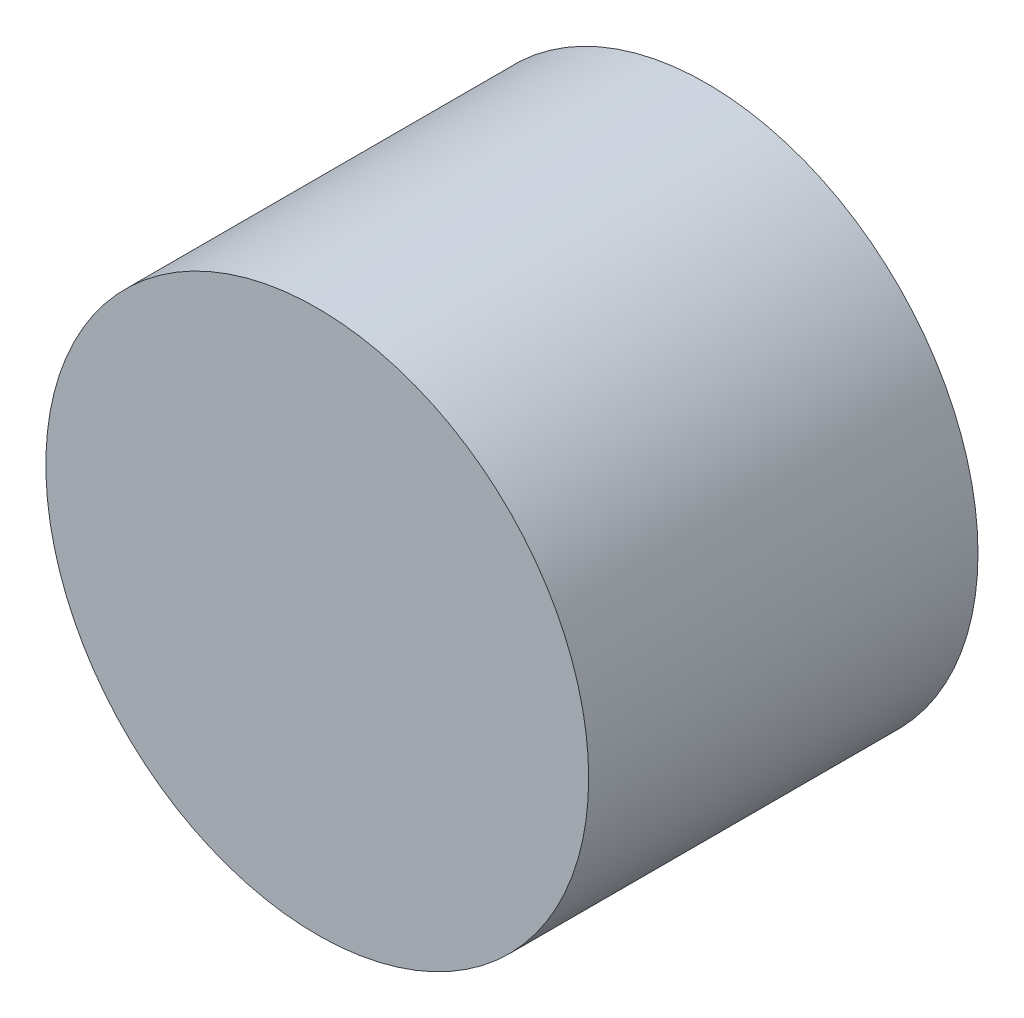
from build123d import *

# Parameters (mm, degrees)
SKETCH_1_R            = 4.95
NOMINAL_U1_BODY_DEPTH = 7.1


with BuildPart() as part:
    # Sketch 1 → Nominal_U1_body (new body)
    with BuildSketch(Plane.XY):
        Circle(SKETCH_1_R)
    extrude(amount=NOMINAL_U1_BODY_DEPTH)


solid = part.part
